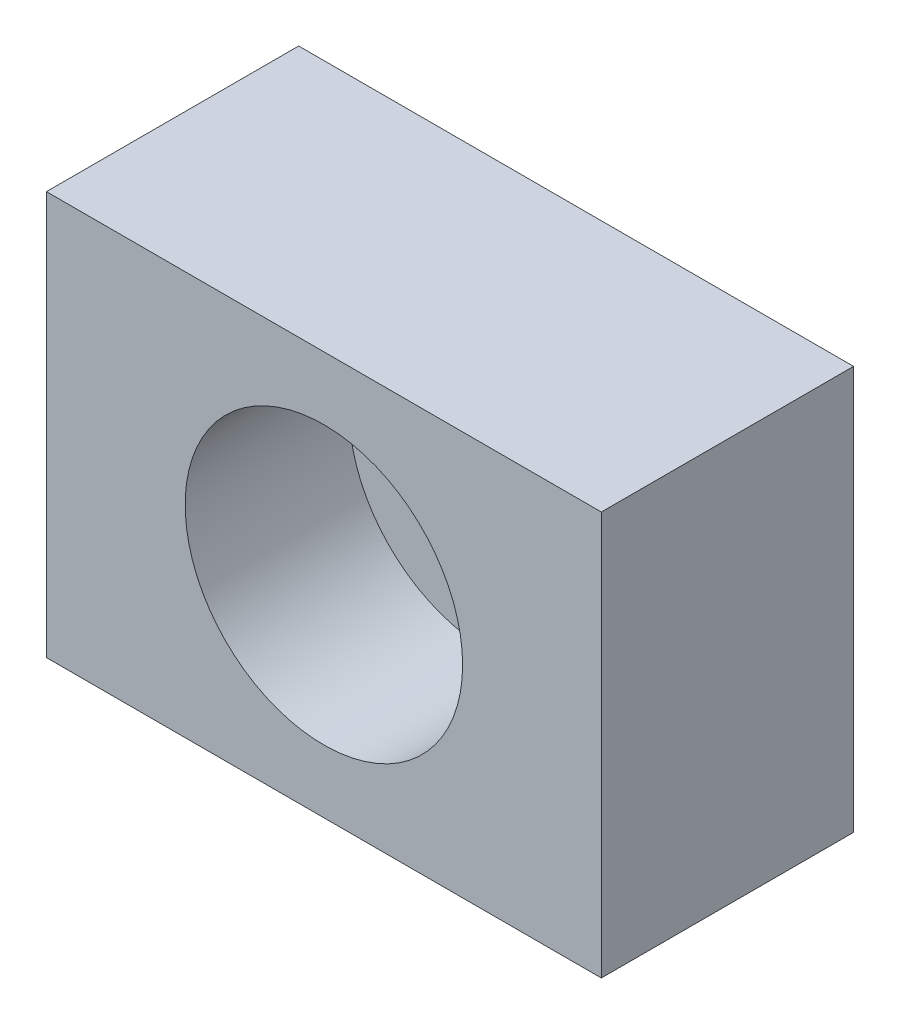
ISO-10303-21;
HEADER;
FILE_DESCRIPTION(('STEP AP214'),'2;1');
FILE_NAME('part.step','',(''),(''),'','','');
FILE_SCHEMA(('AUTOMOTIVE_DESIGN { 1 0 10303 214 1 1 1 1 }'));
ENDSEC;
DATA;
#1=APPLICATION_CONTEXT('core data for automotive mechanical design processes');
#2=APPLICATION_PROTOCOL_DEFINITION('international standard','automotive_design',2000,#1);
#3=PRODUCT_CONTEXT('',#1,'mechanical');
#4=PRODUCT('Part','Part','',(#3));
#5=PRODUCT_RELATED_PRODUCT_CATEGORY('part','',(#4));
#6=PRODUCT_DEFINITION_FORMATION('','',#4);
#7=PRODUCT_DEFINITION_CONTEXT('part definition',#1,'design');
#8=PRODUCT_DEFINITION('design','',#6,#7);
#9=PRODUCT_DEFINITION_SHAPE('','',#8);
#10=(LENGTH_UNIT() NAMED_UNIT(*) SI_UNIT(.MILLI.,.METRE.));
#11=(NAMED_UNIT(*) PLANE_ANGLE_UNIT() SI_UNIT($,.RADIAN.));
#12=(NAMED_UNIT(*) SI_UNIT($,.STERADIAN.) SOLID_ANGLE_UNIT());
#13=UNCERTAINTY_MEASURE_WITH_UNIT(LENGTH_MEASURE(1.E-05),#10,'distance_accuracy_value','');
#14=(GEOMETRIC_REPRESENTATION_CONTEXT(3) GLOBAL_UNCERTAINTY_ASSIGNED_CONTEXT((#13)) GLOBAL_UNIT_ASSIGNED_CONTEXT((#10,
#11,#12)) REPRESENTATION_CONTEXT('',''));
#15=CARTESIAN_POINT('',(0.,0.,0.));
#16=DIRECTION('',(0.,0.,1.));
#17=DIRECTION('',(1.,0.,0.));
#18=AXIS2_PLACEMENT_3D('',#15,#16,#17);
#19=CARTESIAN_POINT('',(11.,-8.,10.));
#20=DIRECTION('',(0.,0.,1.));
#21=DIRECTION('',(1.,0.,0.));
#22=AXIS2_PLACEMENT_3D('',#19,#20,#21);
#23=PLANE('',#22);
#24=DIRECTION('',(1.,0.,0.));
#25=VECTOR('',#24,1.);
#26=CARTESIAN_POINT('',(-11.,-8.,10.));
#27=LINE('',#26,#25);
#28=CARTESIAN_POINT('',(-11.,-8.,10.));
#29=VERTEX_POINT('',#28);
#30=CARTESIAN_POINT('',(11.,-8.,10.));
#31=VERTEX_POINT('',#30);
#32=EDGE_CURVE('E84',#29,#31,#27,.T.);
#33=ORIENTED_EDGE('',*,*,#32,.T.);
#34=DIRECTION('',(0.,1.,0.));
#35=VECTOR('',#34,1.);
#36=CARTESIAN_POINT('',(11.,-8.,10.));
#37=LINE('',#36,#35);
#38=CARTESIAN_POINT('',(11.,8.,10.));
#39=VERTEX_POINT('',#38);
#40=EDGE_CURVE('E61',#31,#39,#37,.T.);
#41=ORIENTED_EDGE('',*,*,#40,.T.);
#42=DIRECTION('',(-1.,0.,0.));
#43=VECTOR('',#42,1.);
#44=CARTESIAN_POINT('',(11.,8.,10.));
#45=LINE('',#44,#43);
#46=CARTESIAN_POINT('',(-11.,8.,10.));
#47=VERTEX_POINT('',#46);
#48=EDGE_CURVE('E81',#39,#47,#45,.T.);
#49=ORIENTED_EDGE('',*,*,#48,.T.);
#50=DIRECTION('',(0.,-1.,0.));
#51=VECTOR('',#50,1.);
#52=CARTESIAN_POINT('',(-11.,8.,10.));
#53=LINE('',#52,#51);
#54=EDGE_CURVE('E78',#47,#29,#53,.T.);
#55=ORIENTED_EDGE('',*,*,#54,.T.);
#56=EDGE_LOOP('',(#33,#41,#49,#55));
#57=FACE_BOUND('',#56,.T.);
#58=CARTESIAN_POINT('',(0.,0.,10.));
#59=DIRECTION('',(0.,0.,1.));
#60=DIRECTION('',(1.,0.,0.));
#61=AXIS2_PLACEMENT_3D('',#58,#59,#60);
#62=CIRCLE('',#61,5.5);
#63=CARTESIAN_POINT('',(5.5,0.,10.));
#64=VERTEX_POINT('',#63);
#65=EDGE_CURVE('E69',#64,#64,#62,.T.);
#66=ORIENTED_EDGE('',*,*,#65,.F.);
#67=EDGE_LOOP('',(#66));
#68=FACE_BOUND('',#67,.T.);
#69=ADVANCED_FACE('F14',(#57,#68),#23,.T.);
#70=CARTESIAN_POINT('',(-11.,-8.,10.));
#71=DIRECTION('',(0.,1.,0.));
#72=DIRECTION('',(0.,0.,1.));
#73=AXIS2_PLACEMENT_3D('',#70,#71,#72);
#74=PLANE('',#73);
#75=DIRECTION('',(0.,0.,-1.));
#76=VECTOR('',#75,1.);
#77=CARTESIAN_POINT('',(11.,-8.,10.));
#78=LINE('',#77,#76);
#79=CARTESIAN_POINT('',(11.,-8.,0.));
#80=VERTEX_POINT('',#79);
#81=EDGE_CURVE('E9',#31,#80,#78,.T.);
#82=ORIENTED_EDGE('',*,*,#81,.F.);
#83=ORIENTED_EDGE('',*,*,#32,.F.);
#84=DIRECTION('',(0.,0.,-1.));
#85=VECTOR('',#84,1.);
#86=CARTESIAN_POINT('',(-11.,-8.,10.));
#87=LINE('',#86,#85);
#88=CARTESIAN_POINT('',(-11.,-8.,0.));
#89=VERTEX_POINT('',#88);
#90=EDGE_CURVE('E29',#29,#89,#87,.T.);
#91=ORIENTED_EDGE('',*,*,#90,.T.);
#92=DIRECTION('',(1.,0.,0.));
#93=VECTOR('',#92,1.);
#94=CARTESIAN_POINT('',(-11.,-8.,0.));
#95=LINE('',#94,#93);
#96=EDGE_CURVE('E65',#89,#80,#95,.T.);
#97=ORIENTED_EDGE('',*,*,#96,.T.);
#98=EDGE_LOOP('',(#82,#83,#91,#97));
#99=FACE_BOUND('',#98,.T.);
#100=ADVANCED_FACE('F66',(#99),#74,.F.);
#101=CARTESIAN_POINT('',(11.,-8.,10.));
#102=DIRECTION('',(-1.,0.,0.));
#103=DIRECTION('',(0.,0.,1.));
#104=AXIS2_PLACEMENT_3D('',#101,#102,#103);
#105=PLANE('',#104);
#106=DIRECTION('',(0.,0.,-1.));
#107=VECTOR('',#106,1.);
#108=CARTESIAN_POINT('',(11.,8.,10.));
#109=LINE('',#108,#107);
#110=CARTESIAN_POINT('',(11.,8.,0.));
#111=VERTEX_POINT('',#110);
#112=EDGE_CURVE('E22',#39,#111,#109,.T.);
#113=ORIENTED_EDGE('',*,*,#112,.F.);
#114=ORIENTED_EDGE('',*,*,#40,.F.);
#115=ORIENTED_EDGE('',*,*,#81,.T.);
#116=DIRECTION('',(0.,1.,0.));
#117=VECTOR('',#116,1.);
#118=CARTESIAN_POINT('',(11.,-8.,0.));
#119=LINE('',#118,#117);
#120=EDGE_CURVE('E58',#80,#111,#119,.T.);
#121=ORIENTED_EDGE('',*,*,#120,.T.);
#122=EDGE_LOOP('',(#113,#114,#115,#121));
#123=FACE_BOUND('',#122,.T.);
#124=ADVANCED_FACE('F16',(#123),#105,.F.);
#125=CARTESIAN_POINT('',(11.,8.,10.));
#126=DIRECTION('',(0.,-1.,0.));
#127=DIRECTION('',(1.,0.,0.));
#128=AXIS2_PLACEMENT_3D('',#125,#126,#127);
#129=PLANE('',#128);
#130=DIRECTION('',(0.,0.,-1.));
#131=VECTOR('',#130,1.);
#132=CARTESIAN_POINT('',(-11.,8.,10.));
#133=LINE('',#132,#131);
#134=CARTESIAN_POINT('',(-11.,8.,0.));
#135=VERTEX_POINT('',#134);
#136=EDGE_CURVE('E37',#47,#135,#133,.T.);
#137=ORIENTED_EDGE('',*,*,#136,.F.);
#138=ORIENTED_EDGE('',*,*,#48,.F.);
#139=ORIENTED_EDGE('',*,*,#112,.T.);
#140=DIRECTION('',(-1.,0.,0.));
#141=VECTOR('',#140,1.);
#142=CARTESIAN_POINT('',(11.,8.,0.));
#143=LINE('',#142,#141);
#144=EDGE_CURVE('E72',#111,#135,#143,.T.);
#145=ORIENTED_EDGE('',*,*,#144,.T.);
#146=EDGE_LOOP('',(#137,#138,#139,#145));
#147=FACE_BOUND('',#146,.T.);
#148=ADVANCED_FACE('F87',(#147),#129,.F.);
#149=CARTESIAN_POINT('',(-11.,8.,10.));
#150=DIRECTION('',(1.,0.,0.));
#151=DIRECTION('',(0.,1.,0.));
#152=AXIS2_PLACEMENT_3D('',#149,#150,#151);
#153=PLANE('',#152);
#154=ORIENTED_EDGE('',*,*,#54,.F.);
#155=ORIENTED_EDGE('',*,*,#136,.T.);
#156=DIRECTION('',(0.,-1.,0.));
#157=VECTOR('',#156,1.);
#158=CARTESIAN_POINT('',(-11.,8.,0.));
#159=LINE('',#158,#157);
#160=EDGE_CURVE('E74',#135,#89,#159,.T.);
#161=ORIENTED_EDGE('',*,*,#160,.T.);
#162=ORIENTED_EDGE('',*,*,#90,.F.);
#163=EDGE_LOOP('',(#154,#155,#161,#162));
#164=FACE_BOUND('',#163,.T.);
#165=ADVANCED_FACE('F90',(#164),#153,.F.);
#166=CARTESIAN_POINT('',(11.,-8.,0.));
#167=DIRECTION('',(0.,0.,1.));
#168=DIRECTION('',(1.,0.,0.));
#169=AXIS2_PLACEMENT_3D('',#166,#167,#168);
#170=PLANE('',#169);
#171=CARTESIAN_POINT('',(0.,0.,0.));
#172=DIRECTION('',(0.,0.,1.));
#173=DIRECTION('',(1.,0.,0.));
#174=AXIS2_PLACEMENT_3D('',#171,#172,#173);
#175=CIRCLE('',#174,3.5);
#176=CARTESIAN_POINT('',(3.5,0.,0.));
#177=VERTEX_POINT('',#176);
#178=EDGE_CURVE('E100',#177,#177,#175,.T.);
#179=ORIENTED_EDGE('',*,*,#178,.T.);
#180=EDGE_LOOP('',(#179));
#181=FACE_BOUND('',#180,.T.);
#182=ORIENTED_EDGE('',*,*,#96,.F.);
#183=ORIENTED_EDGE('',*,*,#160,.F.);
#184=ORIENTED_EDGE('',*,*,#144,.F.);
#185=ORIENTED_EDGE('',*,*,#120,.F.);
#186=EDGE_LOOP('',(#182,#183,#184,#185));
#187=FACE_BOUND('',#186,.T.);
#188=ADVANCED_FACE('F71',(#181,#187),#170,.F.);
#189=CARTESIAN_POINT('',(0.,0.,10.));
#190=DIRECTION('',(0.,0.,1.));
#191=DIRECTION('',(1.,0.,0.));
#192=AXIS2_PLACEMENT_3D('',#189,#190,#191);
#193=CYLINDRICAL_SURFACE('',#192,5.5);
#194=ORIENTED_EDGE('',*,*,#65,.T.);
#195=EDGE_LOOP('',(#194));
#196=FACE_BOUND('',#195,.T.);
#197=CARTESIAN_POINT('',(0.,0.,3.5));
#198=DIRECTION('',(0.,0.,1.));
#199=DIRECTION('',(1.,0.,0.));
#200=AXIS2_PLACEMENT_3D('',#197,#198,#199);
#201=CIRCLE('',#200,5.5);
#202=CARTESIAN_POINT('',(5.5,0.,3.5));
#203=VERTEX_POINT('',#202);
#204=EDGE_CURVE('E94',#203,#203,#201,.T.);
#205=ORIENTED_EDGE('',*,*,#204,.F.);
#206=EDGE_LOOP('',(#205));
#207=FACE_BOUND('',#206,.T.);
#208=ADVANCED_FACE('F114',(#196,#207),#193,.F.);
#209=CARTESIAN_POINT('',(3.5,0.,3.5));
#210=DIRECTION('',(0.,0.,1.));
#211=DIRECTION('',(1.,0.,0.));
#212=AXIS2_PLACEMENT_3D('',#209,#210,#211);
#213=PLANE('',#212);
#214=ORIENTED_EDGE('',*,*,#204,.T.);
#215=EDGE_LOOP('',(#214));
#216=FACE_BOUND('',#215,.T.);
#217=CARTESIAN_POINT('',(0.,0.,3.5));
#218=DIRECTION('',(0.,0.,1.));
#219=DIRECTION('',(1.,0.,0.));
#220=AXIS2_PLACEMENT_3D('',#217,#218,#219);
#221=CIRCLE('',#220,3.5);
#222=CARTESIAN_POINT('',(3.5,0.,3.5));
#223=VERTEX_POINT('',#222);
#224=EDGE_CURVE('E97',#223,#223,#221,.T.);
#225=ORIENTED_EDGE('',*,*,#224,.F.);
#226=EDGE_LOOP('',(#225));
#227=FACE_BOUND('',#226,.T.);
#228=ADVANCED_FACE('F107',(#216,#227),#213,.T.);
#229=CARTESIAN_POINT('',(0.,0.,10.));
#230=DIRECTION('',(0.,0.,1.));
#231=DIRECTION('',(1.,0.,0.));
#232=AXIS2_PLACEMENT_3D('',#229,#230,#231);
#233=CYLINDRICAL_SURFACE('',#232,3.5);
#234=ORIENTED_EDGE('',*,*,#224,.T.);
#235=EDGE_LOOP('',(#234));
#236=FACE_BOUND('',#235,.T.);
#237=ORIENTED_EDGE('',*,*,#178,.F.);
#238=EDGE_LOOP('',(#237));
#239=FACE_BOUND('',#238,.T.);
#240=ADVANCED_FACE('F105',(#236,#239),#233,.F.);
#241=CLOSED_SHELL('',(#69,#100,#124,#148,#165,#188,#208,#228,#240));
#242=MANIFOLD_SOLID_BREP('B1',#241);
#243=ADVANCED_BREP_SHAPE_REPRESENTATION('',(#18,#242),#14);
#244=SHAPE_DEFINITION_REPRESENTATION(#9,#243);
ENDSEC;
END-ISO-10303-21;
